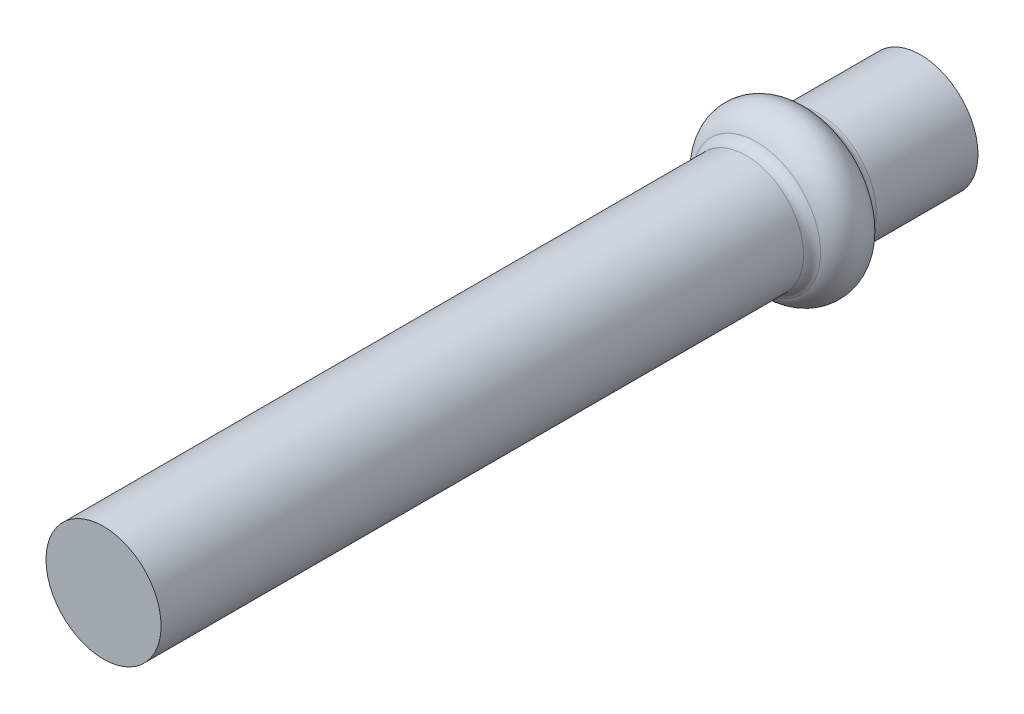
ISO-10303-21;
HEADER;
FILE_DESCRIPTION(('STEP AP214'),'2;1');
FILE_NAME('part.step','',(''),(''),'','','');
FILE_SCHEMA(('AUTOMOTIVE_DESIGN { 1 0 10303 214 1 1 1 1 }'));
ENDSEC;
DATA;
#1=APPLICATION_CONTEXT('core data for automotive mechanical design processes');
#2=APPLICATION_PROTOCOL_DEFINITION('international standard','automotive_design',2000,#1);
#3=PRODUCT_CONTEXT('',#1,'mechanical');
#4=PRODUCT('Part','Part','',(#3));
#5=PRODUCT_RELATED_PRODUCT_CATEGORY('part','',(#4));
#6=PRODUCT_DEFINITION_FORMATION('','',#4);
#7=PRODUCT_DEFINITION_CONTEXT('part definition',#1,'design');
#8=PRODUCT_DEFINITION('design','',#6,#7);
#9=PRODUCT_DEFINITION_SHAPE('','',#8);
#10=(LENGTH_UNIT() NAMED_UNIT(*) SI_UNIT(.MILLI.,.METRE.));
#11=(NAMED_UNIT(*) PLANE_ANGLE_UNIT() SI_UNIT($,.RADIAN.));
#12=(NAMED_UNIT(*) SI_UNIT($,.STERADIAN.) SOLID_ANGLE_UNIT());
#13=UNCERTAINTY_MEASURE_WITH_UNIT(LENGTH_MEASURE(1.E-05),#10,'distance_accuracy_value','');
#14=(GEOMETRIC_REPRESENTATION_CONTEXT(3) GLOBAL_UNCERTAINTY_ASSIGNED_CONTEXT((#13)) GLOBAL_UNIT_ASSIGNED_CONTEXT((#10,
#11,#12)) REPRESENTATION_CONTEXT('',''));
#15=CARTESIAN_POINT('',(0.,0.,0.));
#16=DIRECTION('',(0.,0.,1.));
#17=DIRECTION('',(1.,0.,0.));
#18=AXIS2_PLACEMENT_3D('',#15,#16,#17);
#19=CARTESIAN_POINT('',(0.,0.,0.));
#20=DIRECTION('',(0.,0.,1.));
#21=DIRECTION('',(1.,0.,0.));
#22=AXIS2_PLACEMENT_3D('',#19,#20,#21);
#23=PLANE('',#22);
#24=CARTESIAN_POINT('',(0.,0.,0.));
#25=DIRECTION('',(0.,0.,1.));
#26=DIRECTION('',(1.,0.,0.));
#27=AXIS2_PLACEMENT_3D('',#24,#25,#26);
#28=CIRCLE('',#27,5.);
#29=CARTESIAN_POINT('',(5.,0.,0.));
#30=VERTEX_POINT('',#29);
#31=EDGE_CURVE('E47',#30,#30,#28,.T.);
#32=ORIENTED_EDGE('',*,*,#31,.F.);
#33=EDGE_LOOP('',(#32));
#34=FACE_BOUND('',#33,.T.);
#35=CARTESIAN_POINT('',(0.,0.,0.));
#36=DIRECTION('',(0.,0.,1.));
#37=DIRECTION('',(1.,0.,0.));
#38=AXIS2_PLACEMENT_3D('',#35,#36,#37);
#39=CIRCLE('',#38,4.);
#40=CARTESIAN_POINT('',(4.,0.,0.));
#41=VERTEX_POINT('',#40);
#42=EDGE_CURVE('E50',#41,#41,#39,.T.);
#43=ORIENTED_EDGE('',*,*,#42,.T.);
#44=EDGE_LOOP('',(#43));
#45=FACE_BOUND('',#44,.T.);
#46=ADVANCED_FACE('F24',(#34,#45),#23,.F.);
#47=CARTESIAN_POINT('',(0.,0.,71.));
#48=DIRECTION('',(0.,0.,-1.));
#49=DIRECTION('',(-1.,0.,0.));
#50=AXIS2_PLACEMENT_3D('',#47,#48,#49);
#51=CYLINDRICAL_SURFACE('',#50,5.);
#52=CARTESIAN_POINT('',(0.,0.,8.83772233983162));
#53=DIRECTION('',(0.,0.,1.));
#54=DIRECTION('',(1.,0.,0.));
#55=AXIS2_PLACEMENT_3D('',#52,#53,#54);
#56=CIRCLE('',#55,5.);
#57=CARTESIAN_POINT('',(5.,0.,8.83772233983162));
#58=VERTEX_POINT('',#57);
#59=EDGE_CURVE('E10',#58,#58,#56,.F.);
#60=ORIENTED_EDGE('',*,*,#59,.T.);
#61=EDGE_LOOP('',(#60));
#62=FACE_BOUND('',#61,.T.);
#63=ORIENTED_EDGE('',*,*,#31,.T.);
#64=EDGE_LOOP('',(#63));
#65=FACE_BOUND('',#64,.T.);
#66=ADVANCED_FACE('F26',(#62,#65),#51,.T.);
#67=CARTESIAN_POINT('',(0.,0.,12.));
#68=DIRECTION('',(0.,0.,-1.));
#69=DIRECTION('',(-1.,0.,0.));
#70=AXIS2_PLACEMENT_3D('',#67,#68,#69);
#71=TOROIDAL_SURFACE('',#70,4.5,2.5);
#72=CARTESIAN_POINT('',(0.,0.,9.74123024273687));
#73=DIRECTION('',(0.,0.,1.));
#74=DIRECTION('',(1.,0.,0.));
#75=AXIS2_PLACEMENT_3D('',#72,#73,#74);
#76=CIRCLE('',#75,5.57142857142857);
#77=CARTESIAN_POINT('',(5.57142857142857,0.,9.74123024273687));
#78=VERTEX_POINT('',#77);
#79=EDGE_CURVE('E31',#78,#78,#76,.T.);
#80=ORIENTED_EDGE('',*,*,#79,.T.);
#81=EDGE_LOOP('',(#80));
#82=FACE_BOUND('',#81,.T.);
#83=CARTESIAN_POINT('',(0.,0.,14.2587697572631));
#84=DIRECTION('',(0.,0.,-1.));
#85=DIRECTION('',(-1.,0.,0.));
#86=AXIS2_PLACEMENT_3D('',#83,#84,#85);
#87=CIRCLE('',#86,5.57142857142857);
#88=CARTESIAN_POINT('',(-5.57142857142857,0.,14.2587697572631));
#89=VERTEX_POINT('',#88);
#90=EDGE_CURVE('E39',#89,#89,#87,.T.);
#91=ORIENTED_EDGE('',*,*,#90,.T.);
#92=EDGE_LOOP('',(#91));
#93=FACE_BOUND('',#92,.T.);
#94=ADVANCED_FACE('F93',(#82,#93),#71,.T.);
#95=CARTESIAN_POINT('',(0.,0.,71.));
#96=DIRECTION('',(0.,0.,1.));
#97=DIRECTION('',(1.,0.,0.));
#98=AXIS2_PLACEMENT_3D('',#95,#96,#97);
#99=PLANE('',#98);
#100=CARTESIAN_POINT('',(0.,0.,71.));
#101=DIRECTION('',(0.,0.,1.));
#102=DIRECTION('',(1.,0.,0.));
#103=AXIS2_PLACEMENT_3D('',#100,#101,#102);
#104=CIRCLE('',#103,5.);
#105=CARTESIAN_POINT('',(5.,0.,71.));
#106=VERTEX_POINT('',#105);
#107=EDGE_CURVE('E44',#106,#106,#104,.T.);
#108=ORIENTED_EDGE('',*,*,#107,.T.);
#109=EDGE_LOOP('',(#108));
#110=FACE_BOUND('',#109,.T.);
#111=ADVANCED_FACE('F99',(#110),#99,.T.);
#112=CARTESIAN_POINT('',(0.,0.,15.1622776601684));
#113=DIRECTION('',(0.,0.,-1.));
#114=DIRECTION('',(-1.,0.,0.));
#115=AXIS2_PLACEMENT_3D('',#112,#113,#114);
#116=CIRCLE('',#115,5.);
#117=CARTESIAN_POINT('',(-5.,0.,15.1622776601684));
#118=VERTEX_POINT('',#117);
#119=EDGE_CURVE('E35',#118,#118,#116,.F.);
#120=ORIENTED_EDGE('',*,*,#119,.T.);
#121=EDGE_LOOP('',(#120));
#122=FACE_BOUND('',#121,.T.);
#123=ORIENTED_EDGE('',*,*,#107,.F.);
#124=EDGE_LOOP('',(#123));
#125=FACE_BOUND('',#124,.T.);
#126=ADVANCED_FACE('F94',(#122,#125),#51,.T.);
#127=CARTESIAN_POINT('',(0.,0.,15.1622776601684));
#128=DIRECTION('',(0.,0.,-1.));
#129=DIRECTION('',(-1.,0.,0.));
#130=AXIS2_PLACEMENT_3D('',#127,#128,#129);
#131=TOROIDAL_SURFACE('',#130,6.,1.);
#132=ORIENTED_EDGE('',*,*,#119,.F.);
#133=EDGE_LOOP('',(#132));
#134=FACE_BOUND('',#133,.T.);
#135=ORIENTED_EDGE('',*,*,#90,.F.);
#136=EDGE_LOOP('',(#135));
#137=FACE_BOUND('',#136,.T.);
#138=ADVANCED_FACE('F85',(#134,#137),#131,.F.);
#139=CARTESIAN_POINT('',(0.,0.,8.83772233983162));
#140=DIRECTION('',(0.,0.,1.));
#141=DIRECTION('',(1.,0.,0.));
#142=AXIS2_PLACEMENT_3D('',#139,#140,#141);
#143=TOROIDAL_SURFACE('',#142,6.,1.);
#144=ORIENTED_EDGE('',*,*,#59,.F.);
#145=EDGE_LOOP('',(#144));
#146=FACE_BOUND('',#145,.T.);
#147=ORIENTED_EDGE('',*,*,#79,.F.);
#148=EDGE_LOOP('',(#147));
#149=FACE_BOUND('',#148,.T.);
#150=ADVANCED_FACE('F75',(#146,#149),#143,.F.);
#151=CARTESIAN_POINT('',(0.,0.,61.));
#152=DIRECTION('',(0.,0.,1.));
#153=DIRECTION('',(0.,1.,0.));
#154=AXIS2_PLACEMENT_3D('',#151,#152,#153);
#155=SPHERICAL_SURFACE('',#154,4.00000000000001);
#156=CARTESIAN_POINT('',(0.,0.,61.));
#157=DIRECTION('',(0.,0.,1.));
#158=DIRECTION('',(1.,0.,0.));
#159=AXIS2_PLACEMENT_3D('',#156,#157,#158);
#160=CIRCLE('',#159,4.);
#161=CARTESIAN_POINT('',(4.,0.,61.));
#162=VERTEX_POINT('',#161);
#163=EDGE_CURVE('E65',#162,#162,#160,.T.);
#164=ORIENTED_EDGE('',*,*,#163,.F.);
#165=EDGE_LOOP('',(#164));
#166=FACE_BOUND('',#165,.T.);
#167=ADVANCED_FACE('F72',(#166),#155,.F.);
#168=CARTESIAN_POINT('',(0.,0.,71.));
#169=DIRECTION('',(0.,0.,1.));
#170=DIRECTION('',(1.,0.,0.));
#171=AXIS2_PLACEMENT_3D('',#168,#169,#170);
#172=CYLINDRICAL_SURFACE('',#171,4.);
#173=CARTESIAN_POINT('',(0.,0.,8.83772233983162));
#174=DIRECTION('',(0.,0.,1.));
#175=DIRECTION('',(1.,0.,0.));
#176=AXIS2_PLACEMENT_3D('',#173,#174,#175);
#177=CIRCLE('',#176,4.);
#178=CARTESIAN_POINT('',(4.,0.,8.83772233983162));
#179=VERTEX_POINT('',#178);
#180=EDGE_CURVE('E53',#179,#179,#177,.T.);
#181=ORIENTED_EDGE('',*,*,#180,.T.);
#182=EDGE_LOOP('',(#181));
#183=FACE_BOUND('',#182,.T.);
#184=ORIENTED_EDGE('',*,*,#42,.F.);
#185=EDGE_LOOP('',(#184));
#186=FACE_BOUND('',#185,.T.);
#187=ADVANCED_FACE('F74',(#183,#186),#172,.F.);
#188=CARTESIAN_POINT('',(0.,0.,8.83772233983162));
#189=DIRECTION('',(0.,0.,1.));
#190=DIRECTION('',(1.,0.,0.));
#191=AXIS2_PLACEMENT_3D('',#188,#189,#190);
#192=TOROIDAL_SURFACE('',#191,6.,2.);
#193=CARTESIAN_POINT('',(0.,0.,10.6447381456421));
#194=DIRECTION('',(0.,0.,1.));
#195=DIRECTION('',(1.,0.,0.));
#196=AXIS2_PLACEMENT_3D('',#193,#194,#195);
#197=CIRCLE('',#196,5.14285714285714);
#198=CARTESIAN_POINT('',(5.14285714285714,0.,10.6447381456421));
#199=VERTEX_POINT('',#198);
#200=EDGE_CURVE('E56',#199,#199,#197,.T.);
#201=ORIENTED_EDGE('',*,*,#200,.T.);
#202=EDGE_LOOP('',(#201));
#203=FACE_BOUND('',#202,.T.);
#204=ORIENTED_EDGE('',*,*,#180,.F.);
#205=EDGE_LOOP('',(#204));
#206=FACE_BOUND('',#205,.T.);
#207=ADVANCED_FACE('F81',(#203,#206),#192,.T.);
#208=CARTESIAN_POINT('',(0.,0.,12.));
#209=DIRECTION('',(0.,0.,1.));
#210=DIRECTION('',(1.,0.,0.));
#211=AXIS2_PLACEMENT_3D('',#208,#209,#210);
#212=TOROIDAL_SURFACE('',#211,4.5,1.5);
#213=CARTESIAN_POINT('',(0.,0.,13.3552618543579));
#214=DIRECTION('',(0.,0.,1.));
#215=DIRECTION('',(1.,0.,0.));
#216=AXIS2_PLACEMENT_3D('',#213,#214,#215);
#217=CIRCLE('',#216,5.14285714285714);
#218=CARTESIAN_POINT('',(5.14285714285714,0.,13.3552618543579));
#219=VERTEX_POINT('',#218);
#220=EDGE_CURVE('E59',#219,#219,#217,.T.);
#221=ORIENTED_EDGE('',*,*,#220,.T.);
#222=EDGE_LOOP('',(#221));
#223=FACE_BOUND('',#222,.T.);
#224=ORIENTED_EDGE('',*,*,#200,.F.);
#225=EDGE_LOOP('',(#224));
#226=FACE_BOUND('',#225,.T.);
#227=ADVANCED_FACE('F150',(#223,#226),#212,.F.);
#228=CARTESIAN_POINT('',(0.,0.,15.1622776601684));
#229=DIRECTION('',(0.,0.,1.));
#230=DIRECTION('',(1.,0.,0.));
#231=AXIS2_PLACEMENT_3D('',#228,#229,#230);
#232=TOROIDAL_SURFACE('',#231,6.,2.);
#233=CARTESIAN_POINT('',(0.,0.,15.1622776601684));
#234=DIRECTION('',(0.,0.,1.));
#235=DIRECTION('',(1.,0.,0.));
#236=AXIS2_PLACEMENT_3D('',#233,#234,#235);
#237=CIRCLE('',#236,4.);
#238=CARTESIAN_POINT('',(4.,0.,15.1622776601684));
#239=VERTEX_POINT('',#238);
#240=EDGE_CURVE('E62',#239,#239,#237,.T.);
#241=ORIENTED_EDGE('',*,*,#240,.T.);
#242=EDGE_LOOP('',(#241));
#243=FACE_BOUND('',#242,.T.);
#244=ORIENTED_EDGE('',*,*,#220,.F.);
#245=EDGE_LOOP('',(#244));
#246=FACE_BOUND('',#245,.T.);
#247=ADVANCED_FACE('F158',(#243,#246),#232,.T.);
#248=CARTESIAN_POINT('',(0.,0.,71.));
#249=DIRECTION('',(0.,0.,1.));
#250=DIRECTION('',(1.,0.,0.));
#251=AXIS2_PLACEMENT_3D('',#248,#249,#250);
#252=CYLINDRICAL_SURFACE('',#251,4.);
#253=ORIENTED_EDGE('',*,*,#163,.T.);
#254=EDGE_LOOP('',(#253));
#255=FACE_BOUND('',#254,.T.);
#256=ORIENTED_EDGE('',*,*,#240,.F.);
#257=EDGE_LOOP('',(#256));
#258=FACE_BOUND('',#257,.T.);
#259=ADVANCED_FACE('F69',(#255,#258),#252,.F.);
#260=CLOSED_SHELL('',(#46,#66,#94,#111,#126,#138,#150,#167,#187,#207,#227,#247,#259));
#261=MANIFOLD_SOLID_BREP('B2',#260);
#262=ADVANCED_BREP_SHAPE_REPRESENTATION('',(#18,#261),#14);
#263=SHAPE_DEFINITION_REPRESENTATION(#9,#262);
ENDSEC;
END-ISO-10303-21;
